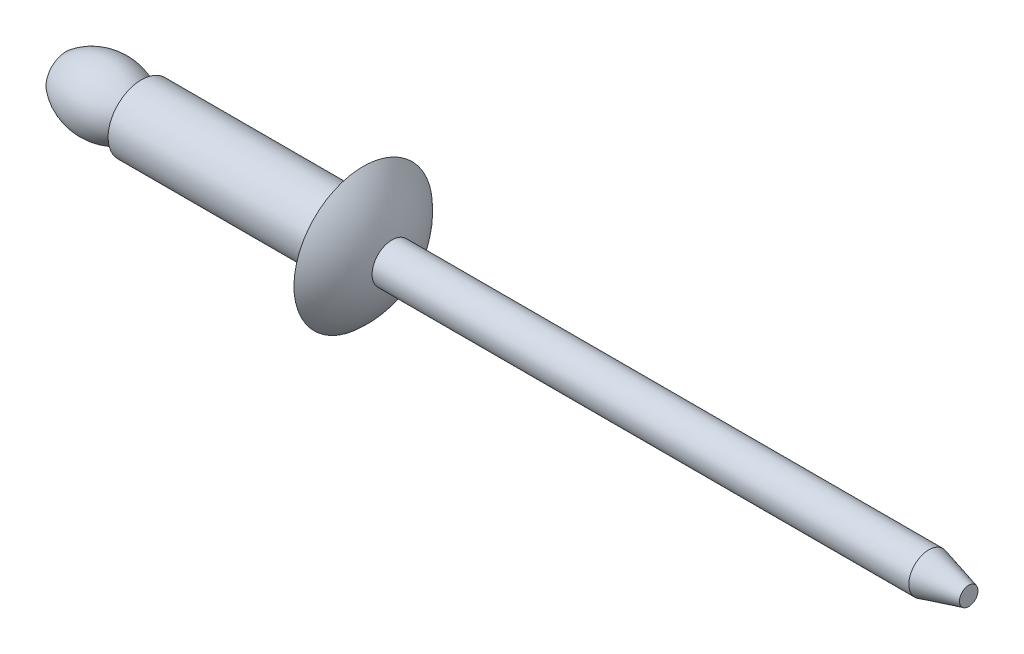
ISO-10303-21;
HEADER;
FILE_DESCRIPTION(('STEP AP214'),'2;1');
FILE_NAME('part.step','',(''),(''),'','','');
FILE_SCHEMA(('AUTOMOTIVE_DESIGN { 1 0 10303 214 1 1 1 1 }'));
ENDSEC;
DATA;
#1=APPLICATION_CONTEXT('core data for automotive mechanical design processes');
#2=APPLICATION_PROTOCOL_DEFINITION('international standard','automotive_design',2000,#1);
#3=PRODUCT_CONTEXT('',#1,'mechanical');
#4=PRODUCT('Part','Part','',(#3));
#5=PRODUCT_RELATED_PRODUCT_CATEGORY('part','',(#4));
#6=PRODUCT_DEFINITION_FORMATION('','',#4);
#7=PRODUCT_DEFINITION_CONTEXT('part definition',#1,'design');
#8=PRODUCT_DEFINITION('design','',#6,#7);
#9=PRODUCT_DEFINITION_SHAPE('','',#8);
#10=(LENGTH_UNIT() NAMED_UNIT(*) SI_UNIT(.MILLI.,.METRE.));
#11=(NAMED_UNIT(*) PLANE_ANGLE_UNIT() SI_UNIT($,.RADIAN.));
#12=(NAMED_UNIT(*) SI_UNIT($,.STERADIAN.) SOLID_ANGLE_UNIT());
#13=UNCERTAINTY_MEASURE_WITH_UNIT(LENGTH_MEASURE(1.E-05),#10,'distance_accuracy_value','');
#14=(GEOMETRIC_REPRESENTATION_CONTEXT(3) GLOBAL_UNCERTAINTY_ASSIGNED_CONTEXT((#13)) GLOBAL_UNIT_ASSIGNED_CONTEXT((#10,
#11,#12)) REPRESENTATION_CONTEXT('',''));
#15=CARTESIAN_POINT('',(0.,0.,0.));
#16=DIRECTION('',(0.,0.,1.));
#17=DIRECTION('',(1.,0.,0.));
#18=AXIS2_PLACEMENT_3D('',#15,#16,#17);
#19=CARTESIAN_POINT('',(22.7342318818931,0.,0.));
#20=DIRECTION('',(1.,0.,0.));
#21=DIRECTION('',(0.,1.,0.));
#22=AXIS2_PLACEMENT_3D('',#19,#20,#21);
#23=CYLINDRICAL_SURFACE('',#22,1.5);
#24=CARTESIAN_POINT('',(12.9,0.,0.));
#25=DIRECTION('',(1.,0.,0.));
#26=DIRECTION('',(0.,1.,0.));
#27=AXIS2_PLACEMENT_3D('',#24,#25,#26);
#28=CIRCLE('',#27,1.5);
#29=CARTESIAN_POINT('',(12.9,1.5,0.));
#30=VERTEX_POINT('',#29);
#31=EDGE_CURVE('E42',#30,#30,#28,.F.);
#32=ORIENTED_EDGE('',*,*,#31,.T.);
#33=EDGE_LOOP('',(#32));
#34=FACE_BOUND('',#33,.T.);
#35=CARTESIAN_POINT('',(3.4,0.,0.));
#36=DIRECTION('',(1.,0.,0.));
#37=DIRECTION('',(0.,1.,0.));
#38=AXIS2_PLACEMENT_3D('',#35,#36,#37);
#39=CIRCLE('',#38,1.5);
#40=CARTESIAN_POINT('',(3.4,1.5,0.));
#41=VERTEX_POINT('',#40);
#42=EDGE_CURVE('E63',#41,#41,#39,.T.);
#43=ORIENTED_EDGE('',*,*,#42,.T.);
#44=EDGE_LOOP('',(#43));
#45=FACE_BOUND('',#44,.T.);
#46=ADVANCED_FACE('F31',(#34,#45),#23,.T.);
#47=CARTESIAN_POINT('',(13.4,-1.5,0.));
#48=DIRECTION('',(1.,0.,0.));
#49=DIRECTION('',(0.,1.,0.));
#50=AXIS2_PLACEMENT_3D('',#47,#48,#49);
#51=PLANE('',#50);
#52=CARTESIAN_POINT('',(13.4,0.,0.));
#53=DIRECTION('',(1.,0.,0.));
#54=DIRECTION('',(0.,1.,0.));
#55=AXIS2_PLACEMENT_3D('',#52,#53,#54);
#56=CIRCLE('',#55,2.);
#57=CARTESIAN_POINT('',(13.4,2.,0.));
#58=VERTEX_POINT('',#57);
#59=EDGE_CURVE('E46',#58,#58,#56,.T.);
#60=ORIENTED_EDGE('',*,*,#59,.T.);
#61=EDGE_LOOP('',(#60));
#62=FACE_BOUND('',#61,.T.);
#63=CARTESIAN_POINT('',(13.4,0.,0.));
#64=DIRECTION('',(1.,0.,0.));
#65=DIRECTION('',(0.,1.,0.));
#66=AXIS2_PLACEMENT_3D('',#63,#64,#65);
#67=CIRCLE('',#66,3.12);
#68=CARTESIAN_POINT('',(13.4,-3.12,0.));
#69=VERTEX_POINT('',#68);
#70=EDGE_CURVE('E51',#69,#69,#67,.T.);
#71=ORIENTED_EDGE('',*,*,#70,.F.);
#72=EDGE_LOOP('',(#71));
#73=FACE_BOUND('',#72,.T.);
#74=ADVANCED_FACE('F91',(#62,#73),#51,.F.);
#75=CARTESIAN_POINT('',(10.6234285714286,0.,0.));
#76=DIRECTION('',(1.,0.,0.));
#77=DIRECTION('',(0.,-1.,0.));
#78=AXIS2_PLACEMENT_3D('',#75,#76,#77);
#79=SPHERICAL_SURFACE('',#78,4.17657142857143);
#80=CARTESIAN_POINT('',(14.7018778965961,0.,0.));
#81=DIRECTION('',(1.,0.,0.));
#82=DIRECTION('',(0.,1.,0.));
#83=AXIS2_PLACEMENT_3D('',#80,#81,#82);
#84=CIRCLE('',#83,0.9);
#85=CARTESIAN_POINT('',(14.7018778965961,-0.900000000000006,0.));
#86=VERTEX_POINT('',#85);
#87=EDGE_CURVE('E54',#86,#86,#84,.T.);
#88=CARTESIAN_POINT('',(14.7018778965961,-0.900000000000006,0.));
#89=CARTESIAN_POINT('',(14.6960055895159,-0.926611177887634,0.));
#90=CARTESIAN_POINT('',(14.689872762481,-0.9531648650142,0.));
#91=CARTESIAN_POINT('',(14.6770885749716,-1.00614712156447,0.));
#92=CARTESIAN_POINT('',(14.670437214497,-1.03257569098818,0.));
#93=CARTESIAN_POINT('',(14.6566184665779,-1.08529757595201,0.));
#94=CARTESIAN_POINT('',(14.6494510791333,-1.11159089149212,0.));
#95=CARTESIAN_POINT('',(14.6346030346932,-1.16403219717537,0.));
#96=CARTESIAN_POINT('',(14.6269223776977,-1.1901801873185,0.));
#97=CARTESIAN_POINT('',(14.6110507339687,-1.24232082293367,0.));
#98=CARTESIAN_POINT('',(14.6028597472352,-1.26831346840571,0.));
#99=CARTESIAN_POINT('',(14.5859705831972,-1.32013345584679,0.));
#100=CARTESIAN_POINT('',(14.5772724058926,-1.34596079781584,0.));
#101=CARTESIAN_POINT('',(14.559372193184,-1.39744028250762,0.));
#102=CARTESIAN_POINT('',(14.5501701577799,-1.42309242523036,0.));
#103=CARTESIAN_POINT('',(14.5312657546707,-1.47421168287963,0.));
#104=CARTESIAN_POINT('',(14.5215633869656,-1.49967879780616,0.));
#105=CARTESIAN_POINT('',(14.5016620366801,-1.5504182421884,0.));
#106=CARTESIAN_POINT('',(14.4914630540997,-1.57569057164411,0.));
#107=CARTESIAN_POINT('',(14.4705723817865,-1.62603076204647,0.));
#108=CARTESIAN_POINT('',(14.4598806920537,-1.65109862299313,0.));
#109=CARTESIAN_POINT('',(14.4380087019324,-1.70102027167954,0.));
#110=CARTESIAN_POINT('',(14.4268284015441,-1.7258740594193,0.));
#111=CARTESIAN_POINT('',(14.4039834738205,-1.77535803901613,0.));
#112=CARTESIAN_POINT('',(14.3923188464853,-1.7999882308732,0.));
#113=CARTESIAN_POINT('',(14.368509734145,-1.84901558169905,0.));
#114=CARTESIAN_POINT('',(14.3563652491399,-1.87341274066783,0.));
#115=CARTESIAN_POINT('',(14.3316010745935,-1.92196467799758,0.));
#116=CARTESIAN_POINT('',(14.3189813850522,-1.94611945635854,0.));
#117=CARTESIAN_POINT('',(14.2932716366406,-1.99417737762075,0.));
#118=CARTESIAN_POINT('',(14.2801815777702,-2.01808052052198,0.));
#119=CARTESIAN_POINT('',(14.2535361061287,-2.0656260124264,0.));
#120=CARTESIAN_POINT('',(14.2399806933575,-2.08926836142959,0.));
#121=CARTESIAN_POINT('',(14.2124097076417,-2.13628320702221,0.));
#122=CARTESIAN_POINT('',(14.1983941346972,-2.15965570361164,0.));
#123=CARTESIAN_POINT('',(14.1699081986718,-2.20612188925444,0.));
#124=CARTESIAN_POINT('',(14.1554378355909,-2.22921557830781,0.));
#125=CARTESIAN_POINT('',(14.1260478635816,-2.27511530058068,0.));
#126=CARTESIAN_POINT('',(14.1111282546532,-2.29792133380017,0.));
#127=CARTESIAN_POINT('',(14.0808455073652,-2.34323700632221,0.));
#128=CARTESIAN_POINT('',(14.0654823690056,-2.36574664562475,0.));
#129=CARTESIAN_POINT('',(14.034318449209,-2.41046090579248,0.));
#130=CARTESIAN_POINT('',(14.018517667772,-2.43266552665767,0.));
#131=CARTESIAN_POINT('',(13.9864845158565,-2.47676124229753,0.));
#132=CARTESIAN_POINT('',(13.9702521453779,-2.4986523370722,0.));
#133=CARTESIAN_POINT('',(13.9373620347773,-2.54211261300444,0.));
#134=CARTESIAN_POINT('',(13.9207042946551,-2.56368179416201,0.));
#135=CARTESIAN_POINT('',(13.8869698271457,-2.60648997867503,0.));
#136=CARTESIAN_POINT('',(13.8698930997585,-2.62772898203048,0.));
#137=CARTESIAN_POINT('',(13.8353272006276,-2.6698686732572,0.));
#138=CARTESIAN_POINT('',(13.8178380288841,-2.69076936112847,0.));
#139=CARTESIAN_POINT('',(13.7824539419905,-2.73222441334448,0.));
#140=CARTESIAN_POINT('',(13.7645590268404,-2.75277877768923,0.));
#141=CARTESIAN_POINT('',(13.7283703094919,-2.79353330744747,0.));
#142=CARTESIAN_POINT('',(13.7100765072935,-2.81373347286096,0.));
#143=CARTESIAN_POINT('',(13.6730970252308,-2.85377186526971,0.));
#144=CARTESIAN_POINT('',(13.6544113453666,-2.87361009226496,0.));
#145=CARTESIAN_POINT('',(13.6166552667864,-2.912917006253,0.));
#146=CARTESIAN_POINT('',(13.5975848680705,-2.9323856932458,0.));
#147=CARTESIAN_POINT('',(13.559066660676,-2.97094607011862,0.));
#148=CARTESIAN_POINT('',(13.5396188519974,-2.99003775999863,0.));
#149=CARTESIAN_POINT('',(13.500353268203,-3.0278368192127,0.));
#150=CARTESIAN_POINT('',(13.480535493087,-3.04654418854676,0.));
#151=CARTESIAN_POINT('',(13.4405375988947,-3.08356747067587,0.));
#152=CARTESIAN_POINT('',(13.4203574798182,-3.10188338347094,0.));
#153=CARTESIAN_POINT('',(13.4,-3.12,0.));
#154=B_SPLINE_CURVE_WITH_KNOTS('',3,(#88,#89,#90,#91,#92,#93,#94,#95,#96,#97,#98,#99,#100,#101,
#102,#103,#104,#105,#106,#107,#108,#109,#110,#111,#112,#113,#114,#115,#116,#117,#118,#119,#120,
#121,#122,#123,#124,#125,#126,#127,#128,#129,#130,#131,#132,#133,#134,#135,#136,#137,#138,#139,
#140,#141,#142,#143,#144,#145,#146,#147,#148,#149,#150,#151,#152,#153),.UNSPECIFIED.,.F.,.F.,(4,
2,2,2,2,2,2,2,2,2,2,2,2,2,2,2,2,2,2,2,2,2,2,2,2,2,2,2,2,2,2,2,4),(0.,0.0817528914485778,
0.163505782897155,0.245258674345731,0.327011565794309,0.408764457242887,0.490517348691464,
0.572270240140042,0.654023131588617,0.735776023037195,0.817528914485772,0.89928180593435,
0.981034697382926,1.0627875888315,1.14454048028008,1.22629337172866,1.30804626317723,
1.38979915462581,1.47155204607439,1.55330493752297,1.63505782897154,1.71681072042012,
1.7985636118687,1.88031650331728,1.96206939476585,2.04382228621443,2.12557517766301,
2.20732806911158,2.28908096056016,2.37083385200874,2.45258674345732,2.53433963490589,
2.61609252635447),.UNSPECIFIED.);
#155=EDGE_CURVE('BSEAM97',#86,#69,#154,.T.);
#156=ORIENTED_EDGE('',*,*,#87,.F.);
#157=ORIENTED_EDGE('',*,*,#70,.T.);
#158=ORIENTED_EDGE('',*,*,#155,.T.);
#159=ORIENTED_EDGE('',*,*,#155,.F.);
#160=EDGE_LOOP('',(#156,#158,#157,#159));
#161=FACE_BOUND('',#160,.T.);
#162=ADVANCED_FACE('F97',(#161),#79,.T.);
#163=CARTESIAN_POINT('',(22.7342318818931,0.,0.));
#164=DIRECTION('',(1.,0.,0.));
#165=DIRECTION('',(0.,1.,0.));
#166=AXIS2_PLACEMENT_3D('',#163,#164,#165);
#167=CYLINDRICAL_SURFACE('',#166,0.900000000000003);
#168=CARTESIAN_POINT('',(38.9018778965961,0.,0.));
#169=DIRECTION('',(-1.,0.,0.));
#170=DIRECTION('',(0.,-1.,0.));
#171=AXIS2_PLACEMENT_3D('',#168,#169,#170);
#172=CIRCLE('',#171,0.900000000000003);
#173=CARTESIAN_POINT('',(38.9018778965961,-0.899999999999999,0.));
#174=VERTEX_POINT('',#173);
#175=EDGE_CURVE('E10',#174,#174,#172,.T.);
#176=ORIENTED_EDGE('',*,*,#175,.T.);
#177=EDGE_LOOP('',(#176));
#178=FACE_BOUND('',#177,.T.);
#179=ORIENTED_EDGE('',*,*,#87,.T.);
#180=EDGE_LOOP('',(#179));
#181=FACE_BOUND('',#180,.T.);
#182=ADVANCED_FACE('F88',(#178,#181),#167,.T.);
#183=CARTESIAN_POINT('',(40.7018778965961,-0.900000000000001,0.));
#184=DIRECTION('',(-1.,0.,0.));
#185=DIRECTION('',(0.,-1.,0.));
#186=AXIS2_PLACEMENT_3D('',#183,#184,#185);
#187=PLANE('',#186);
#188=CARTESIAN_POINT('',(40.7018778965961,0.,0.));
#189=DIRECTION('',(-1.,0.,0.));
#190=DIRECTION('',(0.,-1.,0.));
#191=AXIS2_PLACEMENT_3D('',#188,#189,#190);
#192=CIRCLE('',#191,0.417691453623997);
#193=CARTESIAN_POINT('',(40.7018778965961,-0.417691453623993,0.));
#194=VERTEX_POINT('',#193);
#195=EDGE_CURVE('E38',#194,#194,#192,.F.);
#196=ORIENTED_EDGE('',*,*,#195,.T.);
#197=EDGE_LOOP('',(#196));
#198=FACE_BOUND('',#197,.T.);
#199=ADVANCED_FACE('F83',(#198),#187,.F.);
#200=CARTESIAN_POINT('',(0.,-0.900000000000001,0.));
#201=DIRECTION('',(1.,0.,0.));
#202=DIRECTION('',(0.,1.,0.));
#203=AXIS2_PLACEMENT_3D('',#200,#201,#202);
#204=PLANE('',#203);
#205=CARTESIAN_POINT('',(0.,0.,0.));
#206=DIRECTION('',(1.,0.,0.));
#207=DIRECTION('',(0.,1.,0.));
#208=AXIS2_PLACEMENT_3D('',#205,#206,#207);
#209=CIRCLE('',#208,0.900000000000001);
#210=CARTESIAN_POINT('',(0.,0.900000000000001,0.));
#211=VERTEX_POINT('',#210);
#212=EDGE_CURVE('E57',#211,#211,#209,.T.);
#213=ORIENTED_EDGE('',*,*,#212,.F.);
#214=EDGE_LOOP('',(#213));
#215=FACE_BOUND('',#214,.T.);
#216=ADVANCED_FACE('F78',(#215),#204,.F.);
#217=CARTESIAN_POINT('',(1.7,0.,0.));
#218=DIRECTION('',(1.,0.,0.));
#219=DIRECTION('',(0.,1.,0.));
#220=AXIS2_PLACEMENT_3D('',#217,#218,#219);
#221=DEGENERATE_TOROIDAL_SURFACE('',#220,1.20833333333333,2.70833333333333,.F.);
#222=CARTESIAN_POINT('',(3.4,0.,0.));
#223=DIRECTION('',(1.,0.,0.));
#224=DIRECTION('',(0.,1.,0.));
#225=AXIS2_PLACEMENT_3D('',#222,#223,#224);
#226=CIRCLE('',#225,0.900000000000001);
#227=CARTESIAN_POINT('',(3.4,0.900000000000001,0.));
#228=VERTEX_POINT('',#227);
#229=EDGE_CURVE('E60',#228,#228,#226,.T.);
#230=ORIENTED_EDGE('',*,*,#229,.F.);
#231=EDGE_LOOP('',(#230));
#232=FACE_BOUND('',#231,.T.);
#233=ORIENTED_EDGE('',*,*,#212,.T.);
#234=EDGE_LOOP('',(#233));
#235=FACE_BOUND('',#234,.T.);
#236=ADVANCED_FACE('F72',(#232,#235),#221,.F.);
#237=CARTESIAN_POINT('',(3.4,-0.900000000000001,0.));
#238=DIRECTION('',(1.,0.,0.));
#239=DIRECTION('',(0.,1.,0.));
#240=AXIS2_PLACEMENT_3D('',#237,#238,#239);
#241=PLANE('',#240);
#242=ORIENTED_EDGE('',*,*,#42,.F.);
#243=EDGE_LOOP('',(#242));
#244=FACE_BOUND('',#243,.T.);
#245=ORIENTED_EDGE('',*,*,#229,.T.);
#246=EDGE_LOOP('',(#245));
#247=FACE_BOUND('',#246,.T.);
#248=ADVANCED_FACE('F68',(#244,#247),#241,.F.);
#249=CARTESIAN_POINT('',(12.9,0.,0.));
#250=DIRECTION('',(1.,0.,0.));
#251=DIRECTION('',(0.,1.,0.));
#252=AXIS2_PLACEMENT_3D('',#249,#250,#251);
#253=TOROIDAL_SURFACE('',#252,2.,0.5);
#254=ORIENTED_EDGE('',*,*,#31,.F.);
#255=EDGE_LOOP('',(#254));
#256=FACE_BOUND('',#255,.T.);
#257=ORIENTED_EDGE('',*,*,#59,.F.);
#258=EDGE_LOOP('',(#257));
#259=FACE_BOUND('',#258,.T.);
#260=ADVANCED_FACE('F71',(#256,#259),#253,.F.);
#261=CARTESIAN_POINT('',(40.7018778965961,0.,0.));
#262=DIRECTION('',(-1.,0.,0.));
#263=DIRECTION('',(0.,-1.,0.));
#264=AXIS2_PLACEMENT_3D('',#261,#262,#263);
#265=CONICAL_SURFACE('',#264,0.417691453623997,0.261799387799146);
#266=ORIENTED_EDGE('',*,*,#175,.F.);
#267=EDGE_LOOP('',(#266));
#268=FACE_BOUND('',#267,.T.);
#269=ORIENTED_EDGE('',*,*,#195,.F.);
#270=EDGE_LOOP('',(#269));
#271=FACE_BOUND('',#270,.T.);
#272=ADVANCED_FACE('F33',(#268,#271),#265,.T.);
#273=CLOSED_SHELL('',(#46,#74,#162,#182,#199,#216,#236,#248,#260,#272));
#274=MANIFOLD_SOLID_BREP('B2',#273);
#275=ADVANCED_BREP_SHAPE_REPRESENTATION('',(#18,#274),#14);
#276=SHAPE_DEFINITION_REPRESENTATION(#9,#275);
ENDSEC;
END-ISO-10303-21;
